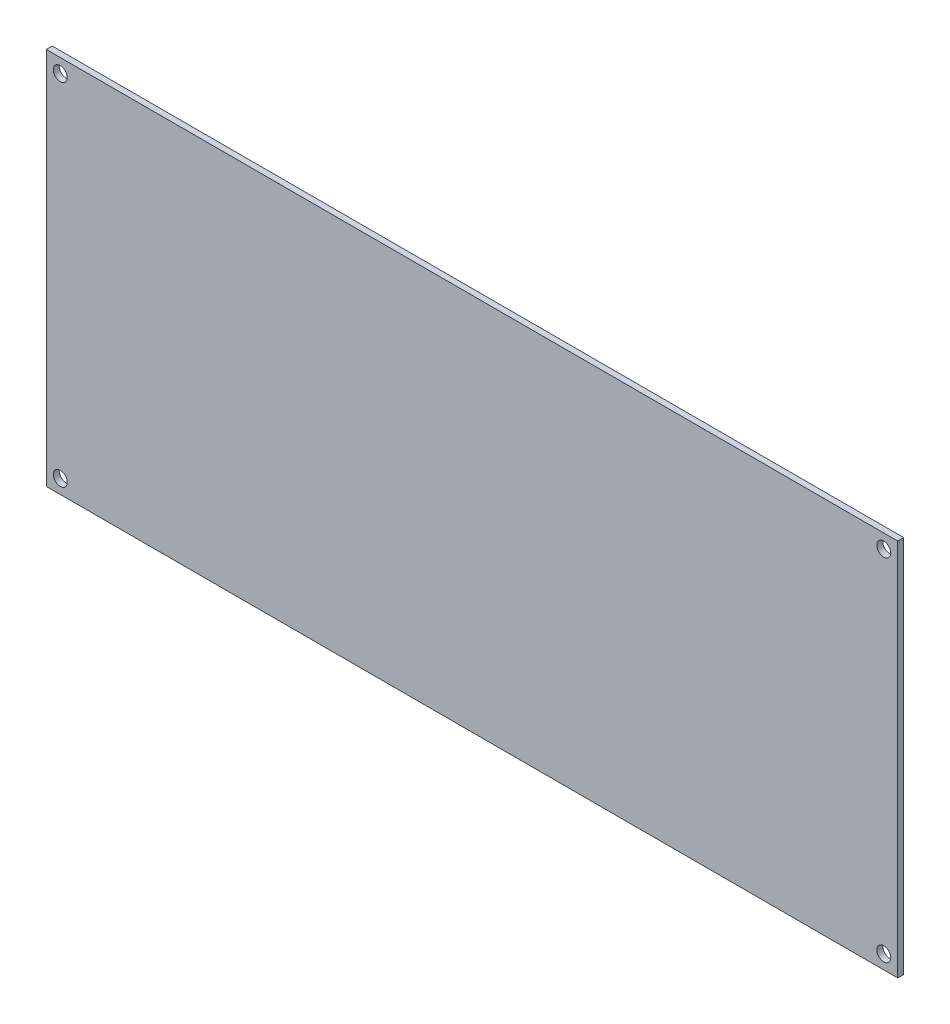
from build123d import *

# Parameters (mm, degrees)
SKETCH1_W      = 228.6
SKETCH1_H      = 101.6
EXTRUDE1_DEPTH = 1.6
SKETCH3_R      = 1.875
EXTRUDE3_DEPTH = 251.166104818


with BuildPart() as part:
    # Sketch1 → Extrude1 (new body)
    with BuildSketch(Plane.XY):
        with Locations((114.3, 50.8)):
            Rectangle(SKETCH1_W, SKETCH1_H)
    extrude(amount=EXTRUDE1_DEPTH)

    # Sketch3 → Extrude3 (cut, through all)
    with BuildSketch(Plane.XY.offset(1.6)):
        with Locations((3.75, 97.85)):
            Circle(SKETCH3_R)
        with Locations((224.85, 97.85)):
            Circle(SKETCH3_R)
        with Locations((224.85, 3.75)):
            Circle(SKETCH3_R)
        with Locations((3.75, 3.75)):
            Circle(SKETCH3_R)
    extrude(amount=-EXTRUDE3_DEPTH, mode=Mode.SUBTRACT)


solid = part.part
